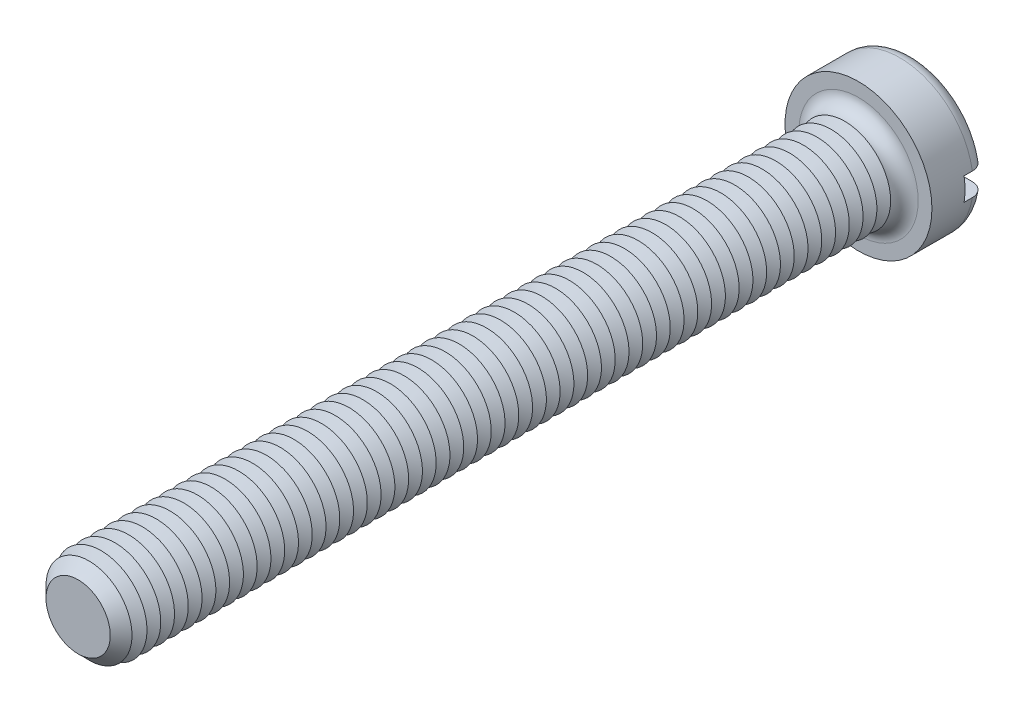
from build123d import *

# Parameters (mm, degrees)
SKETCH3_R           = 8
BOSS_EXTRUDE2_DEPTH = 6
SKETCH4_R           = 5
BOSS_EXTRUDE3_DEPTH = 85
FILLET1_R           = 1.5
CHAMFER1_SIZE       = 1.5
LPATTERN1_COUNT     = 55
LPATTERN1_PITCH     = 1.5
SKETCH8_W           = 16
SKETCH8_H           = 2.5
CUT_EXTRUDE1_DEPTH  = 2.4


with BuildPart() as part:
    # Sketch3 → Boss-Extrude2 (new body)
    with BuildSketch(Plane.XY):
        Circle(SKETCH3_R)
    extrude(amount=-BOSS_EXTRUDE2_DEPTH)

    # Sketch4 → Boss-Extrude3 (add)
    with BuildSketch(Plane.XY):
        Circle(SKETCH4_R)
    extrude(amount=BOSS_EXTRUDE3_DEPTH)

    # Fillet1
    fillet1_edges = [part.edges().sort_by_distance(p)[0] for p in [
        (-8, 0, -6),
        (-5, 0, 0),
    ]]
    fillet(fillet1_edges, radius=FILLET1_R)

    # Chamfer1
    chamfer1_edges = [part.edges().sort_by_distance(p)[0] for p in [
        (-5, 0, 85),
    ]]
    chamfer(chamfer1_edges, length=CHAMFER1_SIZE)

    # Sketch6 → Cut-Revolve1 (revolve, cut)
    with BuildSketch(Plane(origin=(0, 0, 0), x_dir=(0, 0, -1), z_dir=(1, 0, 0)), mode=Mode.PRIVATE) as cut_revolve1_sk:
        Polygon((-1.5, 5), (-2.25, 3.700961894), (-3, 5), align=None)
    cut_revolve1 = revolve(cut_revolve1_sk.sketch.rotate(Axis((0, 0, -1.694361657), (0, 0, 1)), 90), axis=Axis((0, 0, -1.694361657), (0, 0, 1)), mode=Mode.SUBTRACT)

    # LPattern1: Cut-Revolve1 ×55
    with Locations(*[(0, 0, i * LPATTERN1_PITCH) for i in range(1, LPATTERN1_COUNT)]):
        add(cut_revolve1, mode=Mode.SUBTRACT)

    # Sketch8 → Cut-Extrude1 (cut)
    with BuildSketch(Plane(origin=(0, 0, -6), x_dir=(-1, 0, 0), z_dir=(0, 0, -1))):
        Rectangle(SKETCH8_W, SKETCH8_H)
    extrude(amount=-CUT_EXTRUDE1_DEPTH, mode=Mode.SUBTRACT)


solid = part.part
